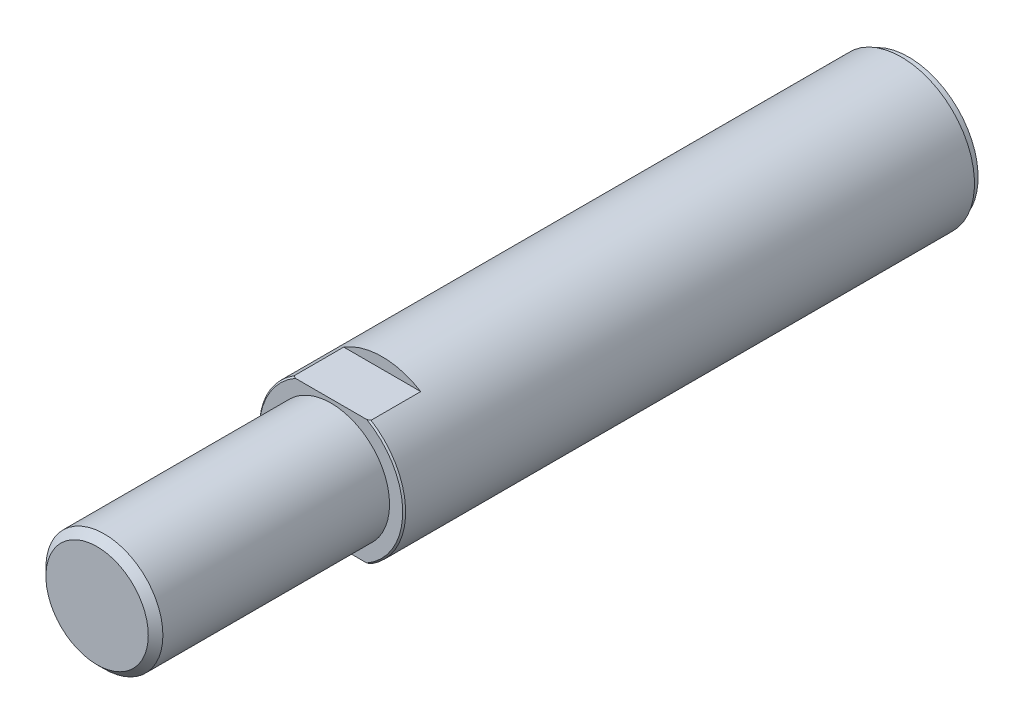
ISO-10303-21;
HEADER;
FILE_DESCRIPTION(('STEP AP214'),'2;1');
FILE_NAME('part.step','',(''),(''),'','','');
FILE_SCHEMA(('AUTOMOTIVE_DESIGN { 1 0 10303 214 1 1 1 1 }'));
ENDSEC;
DATA;
#1=APPLICATION_CONTEXT('core data for automotive mechanical design processes');
#2=APPLICATION_PROTOCOL_DEFINITION('international standard','automotive_design',2000,#1);
#3=PRODUCT_CONTEXT('',#1,'mechanical');
#4=PRODUCT('Part','Part','',(#3));
#5=PRODUCT_RELATED_PRODUCT_CATEGORY('part','',(#4));
#6=PRODUCT_DEFINITION_FORMATION('','',#4);
#7=PRODUCT_DEFINITION_CONTEXT('part definition',#1,'design');
#8=PRODUCT_DEFINITION('design','',#6,#7);
#9=PRODUCT_DEFINITION_SHAPE('','',#8);
#10=(LENGTH_UNIT() NAMED_UNIT(*) SI_UNIT(.MILLI.,.METRE.));
#11=(NAMED_UNIT(*) PLANE_ANGLE_UNIT() SI_UNIT($,.RADIAN.));
#12=(NAMED_UNIT(*) SI_UNIT($,.STERADIAN.) SOLID_ANGLE_UNIT());
#13=UNCERTAINTY_MEASURE_WITH_UNIT(LENGTH_MEASURE(1.E-05),#10,'distance_accuracy_value','');
#14=(GEOMETRIC_REPRESENTATION_CONTEXT(3) GLOBAL_UNCERTAINTY_ASSIGNED_CONTEXT((#13)) GLOBAL_UNIT_ASSIGNED_CONTEXT((#10,
#11,#12)) REPRESENTATION_CONTEXT('',''));
#15=CARTESIAN_POINT('',(0.,0.,0.));
#16=DIRECTION('',(0.,0.,1.));
#17=DIRECTION('',(1.,0.,0.));
#18=AXIS2_PLACEMENT_3D('',#15,#16,#17);
#19=CARTESIAN_POINT('',(0.,0.,111.));
#20=DIRECTION('',(0.,0.,-1.));
#21=DIRECTION('',(-1.,0.,0.));
#22=AXIS2_PLACEMENT_3D('',#19,#20,#21);
#23=CYLINDRICAL_SURFACE('',#22,10.);
#24=CARTESIAN_POINT('',(0.,0.,1.));
#25=DIRECTION('',(0.,0.,-1.));
#26=DIRECTION('',(-1.,0.,0.));
#27=AXIS2_PLACEMENT_3D('',#24,#25,#26);
#28=CIRCLE('',#27,10.);
#29=CARTESIAN_POINT('',(-10.,0.,1.));
#30=VERTEX_POINT('',#29);
#31=EDGE_CURVE('E197',#30,#30,#28,.T.);
#32=ORIENTED_EDGE('',*,*,#31,.F.);
#33=EDGE_LOOP('',(#32));
#34=FACE_BOUND('',#33,.T.);
#35=DIRECTION('',(0.,0.,-1.));
#36=VECTOR('',#35,1.);
#37=CARTESIAN_POINT('',(-5.26782687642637,-8.5,111.));
#38=LINE('',#37,#36);
#39=CARTESIAN_POINT('',(-5.26782687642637,-8.5,78.8));
#40=VERTEX_POINT('',#39);
#41=CARTESIAN_POINT('',(-5.26782687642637,-8.5,72.));
#42=VERTEX_POINT('',#41);
#43=EDGE_CURVE('E209',#40,#42,#38,.T.);
#44=ORIENTED_EDGE('',*,*,#43,.F.);
#45=CARTESIAN_POINT('',(0.,0.,78.8));
#46=DIRECTION('',(0.,0.,1.));
#47=DIRECTION('',(1.,0.,0.));
#48=AXIS2_PLACEMENT_3D('',#45,#46,#47);
#49=CIRCLE('',#48,10.);
#50=CARTESIAN_POINT('',(-5.26782687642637,8.5,78.8));
#51=VERTEX_POINT('',#50);
#52=EDGE_CURVE('E129',#40,#51,#49,.F.);
#53=ORIENTED_EDGE('',*,*,#52,.T.);
#54=DIRECTION('',(0.,0.,-1.));
#55=VECTOR('',#54,1.);
#56=CARTESIAN_POINT('',(-5.26782687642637,8.5,111.));
#57=LINE('',#56,#55);
#58=CARTESIAN_POINT('',(-5.26782687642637,8.5,72.));
#59=VERTEX_POINT('',#58);
#60=EDGE_CURVE('E58',#59,#51,#57,.F.);
#61=ORIENTED_EDGE('',*,*,#60,.F.);
#62=CARTESIAN_POINT('',(0.,0.,72.));
#63=DIRECTION('',(0.,0.,1.));
#64=DIRECTION('',(1.,0.,0.));
#65=AXIS2_PLACEMENT_3D('',#62,#63,#64);
#66=CIRCLE('',#65,10.);
#67=CARTESIAN_POINT('',(5.26782687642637,8.5,72.));
#68=VERTEX_POINT('',#67);
#69=EDGE_CURVE('E47',#68,#59,#66,.T.);
#70=ORIENTED_EDGE('',*,*,#69,.F.);
#71=DIRECTION('',(0.,0.,-1.));
#72=VECTOR('',#71,1.);
#73=CARTESIAN_POINT('',(5.26782687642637,8.5,111.));
#74=LINE('',#73,#72);
#75=CARTESIAN_POINT('',(5.26782687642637,8.5,78.8));
#76=VERTEX_POINT('',#75);
#77=EDGE_CURVE('E214',#76,#68,#74,.T.);
#78=ORIENTED_EDGE('',*,*,#77,.F.);
#79=CARTESIAN_POINT('',(5.26782687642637,-8.5,78.8));
#80=VERTEX_POINT('',#79);
#81=EDGE_CURVE('E116',#76,#80,#49,.F.);
#82=ORIENTED_EDGE('',*,*,#81,.T.);
#83=DIRECTION('',(0.,0.,-1.));
#84=VECTOR('',#83,1.);
#85=CARTESIAN_POINT('',(5.26782687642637,-8.5,111.));
#86=LINE('',#85,#84);
#87=CARTESIAN_POINT('',(5.26782687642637,-8.5,72.));
#88=VERTEX_POINT('',#87);
#89=EDGE_CURVE('E66',#88,#80,#86,.F.);
#90=ORIENTED_EDGE('',*,*,#89,.F.);
#91=EDGE_CURVE('E12',#42,#88,#66,.T.);
#92=ORIENTED_EDGE('',*,*,#91,.F.);
#93=EDGE_LOOP('',(#44,#53,#61,#70,#78,#82,#90,#92));
#94=FACE_BOUND('',#93,.T.);
#95=ADVANCED_FACE('F42',(#34,#94),#23,.T.);
#96=CARTESIAN_POINT('',(0.,0.,79.));
#97=DIRECTION('',(0.,0.,1.));
#98=DIRECTION('',(1.,0.,0.));
#99=AXIS2_PLACEMENT_3D('',#96,#97,#98);
#100=PLANE('',#99);
#101=CARTESIAN_POINT('',(0.,0.,79.));
#102=DIRECTION('',(0.,0.,1.));
#103=DIRECTION('',(1.,0.,0.));
#104=AXIS2_PLACEMENT_3D('',#101,#102,#103);
#105=CIRCLE('',#104,8.);
#106=CARTESIAN_POINT('',(8.,0.,79.));
#107=VERTEX_POINT('',#106);
#108=EDGE_CURVE('E192',#107,#107,#105,.T.);
#109=ORIENTED_EDGE('',*,*,#108,.F.);
#110=EDGE_LOOP('',(#109));
#111=FACE_BOUND('',#110,.T.);
#112=CARTESIAN_POINT('',(0.,0.,79.));
#113=DIRECTION('',(0.,0.,1.));
#114=DIRECTION('',(1.,0.,0.));
#115=AXIS2_PLACEMENT_3D('',#112,#113,#114);
#116=CIRCLE('',#115,9.8);
#117=CARTESIAN_POINT('',(-4.87749935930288,8.5,79.));
#118=VERTEX_POINT('',#117);
#119=CARTESIAN_POINT('',(-4.87749935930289,-8.5,79.));
#120=VERTEX_POINT('',#119);
#121=EDGE_CURVE('E121',#118,#120,#116,.T.);
#122=ORIENTED_EDGE('',*,*,#121,.T.);
#123=DIRECTION('',(1.,0.,0.));
#124=VECTOR('',#123,1.);
#125=CARTESIAN_POINT('',(-15.7370542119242,-8.5,79.));
#126=LINE('',#125,#124);
#127=CARTESIAN_POINT('',(4.87749935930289,-8.5,79.));
#128=VERTEX_POINT('',#127);
#129=EDGE_CURVE('E108',#120,#128,#126,.T.);
#130=ORIENTED_EDGE('',*,*,#129,.T.);
#131=CARTESIAN_POINT('',(4.87749935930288,8.5,79.));
#132=VERTEX_POINT('',#131);
#133=EDGE_CURVE('E114',#128,#132,#116,.T.);
#134=ORIENTED_EDGE('',*,*,#133,.T.);
#135=DIRECTION('',(-1.,0.,0.));
#136=VECTOR('',#135,1.);
#137=CARTESIAN_POINT('',(-15.7370542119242,8.5,79.));
#138=LINE('',#137,#136);
#139=EDGE_CURVE('E98',#132,#118,#138,.T.);
#140=ORIENTED_EDGE('',*,*,#139,.T.);
#141=EDGE_LOOP('',(#122,#130,#134,#140));
#142=FACE_BOUND('',#141,.T.);
#143=ADVANCED_FACE('F120',(#111,#142),#100,.T.);
#144=CARTESIAN_POINT('',(0.,0.,79.));
#145=DIRECTION('',(0.,0.,-1.));
#146=DIRECTION('',(-1.,0.,0.));
#147=AXIS2_PLACEMENT_3D('',#144,#145,#146);
#148=CONICAL_SURFACE('',#147,9.8,0.785398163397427);
#149=ORIENTED_EDGE('',*,*,#52,.F.);
#150=CARTESIAN_POINT('',(-20.2924912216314,-8.5,66.7992000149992));
#151=CARTESIAN_POINT('',(-19.9903151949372,-8.5,67.0779050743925));
#152=CARTESIAN_POINT('',(-19.6876831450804,-8.5,67.3561166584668));
#153=CARTESIAN_POINT('',(-19.0813686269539,-8.5,67.9113972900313));
#154=CARTESIAN_POINT('',(-18.7776861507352,-8.5,68.1884663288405));
#155=CARTESIAN_POINT('',(-18.1690691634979,-8.5,68.7413636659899));
#156=CARTESIAN_POINT('',(-17.8641343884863,-8.5,69.0171916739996));
#157=CARTESIAN_POINT('',(-17.2529099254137,-8.5,69.5673395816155));
#158=CARTESIAN_POINT('',(-16.9466202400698,-8.5,69.8416594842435));
#159=CARTESIAN_POINT('',(-16.0217547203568,-8.5,70.6653051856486));
#160=CARTESIAN_POINT('',(-15.400823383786,-8.5,71.2119999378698));
#161=CARTESIAN_POINT('',(-14.4631651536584,-8.5,72.0247482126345));
#162=CARTESIAN_POINT('',(-14.1495854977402,-8.5,72.294434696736));
#163=CARTESIAN_POINT('',(-13.5199535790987,-8.5,72.8309076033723));
#164=CARTESIAN_POINT('',(-13.2039013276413,-8.5,73.0976940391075));
#165=CARTESIAN_POINT('',(-12.629428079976,-8.5,73.5772387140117));
#166=CARTESIAN_POINT('',(-12.3715096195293,-8.5,73.7905987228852));
#167=CARTESIAN_POINT('',(-11.8534786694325,-8.5,74.2146372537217));
#168=CARTESIAN_POINT('',(-11.5933661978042,-8.5,74.4253157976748));
#169=CARTESIAN_POINT('',(-11.0705368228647,-8.5,74.843561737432));
#170=CARTESIAN_POINT('',(-10.8078192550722,-8.5,75.0511283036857));
#171=CARTESIAN_POINT('',(-10.2794399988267,-8.5,75.4624820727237));
#172=CARTESIAN_POINT('',(-10.0137783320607,-8.5,75.6662693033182));
#173=CARTESIAN_POINT('',(-9.47930850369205,-8.5,76.0690746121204));
#174=CARTESIAN_POINT('',(-9.21050406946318,-8.5,76.268097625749));
#175=CARTESIAN_POINT('',(-8.6688683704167,-8.5,76.6606243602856));
#176=CARTESIAN_POINT('',(-8.39603694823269,-8.5,76.8541278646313));
#177=CARTESIAN_POINT('',(-7.84577438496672,-8.5,77.2342487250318));
#178=CARTESIAN_POINT('',(-7.56834525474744,-8.5,77.4208689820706));
#179=CARTESIAN_POINT('',(-7.00798119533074,-8.5,77.7856209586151));
#180=CARTESIAN_POINT('',(-6.72504689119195,-8.5,77.963753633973));
#181=CARTESIAN_POINT('',(-6.15573417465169,-8.5,78.307521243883));
#182=CARTESIAN_POINT('',(-5.86942405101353,-8.5,78.4732686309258));
#183=CARTESIAN_POINT('',(-5.28944259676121,-8.5,78.7915327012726));
#184=CARTESIAN_POINT('',(-4.99577045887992,-8.5,78.9440479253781));
#185=CARTESIAN_POINT('',(-4.40042128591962,-8.5,79.2320384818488));
#186=CARTESIAN_POINT('',(-4.09875133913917,-8.5,79.3675283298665));
#187=CARTESIAN_POINT('',(-3.48658234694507,-8.5,79.6169596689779));
#188=CARTESIAN_POINT('',(-3.176085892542,-8.5,79.7309074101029));
#189=CARTESIAN_POINT('',(-2.61467210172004,-8.5,79.9100093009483));
#190=CARTESIAN_POINT('',(-2.36543038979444,-8.5,79.9803861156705));
#191=CARTESIAN_POINT('',(-1.86224774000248,-8.5,80.1018154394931));
#192=CARTESIAN_POINT('',(-1.6083074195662,-8.5,80.1528704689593));
#193=CARTESIAN_POINT('',(-1.0977393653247,-8.5,80.2331036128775));
#194=CARTESIAN_POINT('',(-0.841122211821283,-8.5,80.2623480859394));
#195=CARTESIAN_POINT('',(-0.326281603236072,-8.5,80.29761577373));
#196=CARTESIAN_POINT('',(-0.0680582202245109,-8.5,80.3036400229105));
#197=CARTESIAN_POINT('',(0.448290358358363,-8.5,80.2921082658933));
#198=CARTESIAN_POINT('',(0.70641464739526,-8.5,80.2745123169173));
#199=CARTESIAN_POINT('',(1.22009338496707,-8.5,80.216676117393));
#200=CARTESIAN_POINT('',(1.47564761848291,-8.5,80.1764339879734));
#201=CARTESIAN_POINT('',(1.98337628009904,-8.5,80.0752276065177));
#202=CARTESIAN_POINT('',(2.23553793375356,-8.5,80.0142001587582));
#203=CARTESIAN_POINT('',(2.73474214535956,-8.5,79.8741177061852));
#204=CARTESIAN_POINT('',(2.98178457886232,-8.5,79.7950622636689));
#205=CARTESIAN_POINT('',(3.50854802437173,-8.5,79.608148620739));
#206=CARTESIAN_POINT('',(3.78735046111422,-8.5,79.4977206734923));
#207=CARTESIAN_POINT('',(4.33788024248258,-8.5,79.2603215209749));
#208=CARTESIAN_POINT('',(4.60960435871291,-8.5,79.1333429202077));
#209=CARTESIAN_POINT('',(5.14688206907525,-8.5,78.8659166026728));
#210=CARTESIAN_POINT('',(5.41242408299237,-8.5,78.7254457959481));
#211=CARTESIAN_POINT('',(5.9375223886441,-8.5,78.4338769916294));
#212=CARTESIAN_POINT('',(6.19707948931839,-8.5,78.282780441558));
#213=CARTESIAN_POINT('',(6.71410320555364,-8.5,77.9701206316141));
#214=CARTESIAN_POINT('',(6.97150611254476,-8.5,77.808452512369));
#215=CARTESIAN_POINT('',(7.48168749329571,-8.5,77.4779909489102));
#216=CARTESIAN_POINT('',(7.73446585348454,-8.5,77.3091973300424));
#217=CARTESIAN_POINT('',(8.2357615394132,-8.5,76.9659626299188));
#218=CARTESIAN_POINT('',(8.48428301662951,-8.5,76.7915275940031));
#219=CARTESIAN_POINT('',(8.97788664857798,-8.5,76.4378472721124));
#220=CARTESIAN_POINT('',(9.22296865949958,-8.5,76.2586017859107));
#221=CARTESIAN_POINT('',(9.7110747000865,-8.5,75.895416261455));
#222=CARTESIAN_POINT('',(9.9540873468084,-8.5,75.7114609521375));
#223=CARTESIAN_POINT('',(10.4375034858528,-8.5,75.3401497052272));
#224=CARTESIAN_POINT('',(10.6779069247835,-8.5,75.1527936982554));
#225=CARTESIAN_POINT('',(11.3957533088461,-8.5,74.5863995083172));
#226=CARTESIAN_POINT('',(11.8698018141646,-8.5,74.2030580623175));
#227=CARTESIAN_POINT('',(12.8113026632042,-8.5,73.4276757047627));
#228=CARTESIAN_POINT('',(13.2787496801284,-8.5,73.0356283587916));
#229=CARTESIAN_POINT('',(14.2082094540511,-8.5,72.2451370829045));
#230=CARTESIAN_POINT('',(14.6702221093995,-8.5,71.8466930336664));
#231=CARTESIAN_POINT('',(15.5667112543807,-8.5,71.065095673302));
#232=CARTESIAN_POINT('',(16.0014004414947,-8.5,70.6821858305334));
#233=CARTESIAN_POINT('',(16.8676102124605,-8.5,69.9127893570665));
#234=CARTESIAN_POINT('',(17.2991307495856,-8.5,69.5263026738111));
#235=CARTESIAN_POINT('',(18.1588700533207,-8.5,68.7510598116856));
#236=CARTESIAN_POINT('',(18.5870930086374,-8.5,68.362308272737));
#237=CARTESIAN_POINT('',(19.4413362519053,-8.5,67.5824227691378));
#238=CARTESIAN_POINT('',(19.8673566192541,-8.5,67.1912888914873));
#239=CARTESIAN_POINT('',(20.2924912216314,-8.5,66.7992000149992));
#240=B_SPLINE_CURVE_WITH_KNOTS('',3,(#150,#151,#152,#153,#154,#155,#156,#157,#158,#159,#160,
#161,#162,#163,#164,#165,#166,#167,#168,#169,#170,#171,#172,#173,#174,#175,#176,#177,#178,#179,
#180,#181,#182,#183,#184,#185,#186,#187,#188,#189,#190,#191,#192,#193,#194,#195,#196,#197,#198,
#199,#200,#201,#202,#203,#204,#205,#206,#207,#208,#209,#210,#211,#212,#213,#214,#215,#216,#217,
#218,#219,#220,#221,#222,#223,#224,#225,#226,#227,#228,#229,#230,#231,#232,#233,#234,#235,#236,
#237,#238,#239),.UNSPECIFIED.,.F.,.F.,(4,2,2,2,2,2,2,2,2,2,2,2,2,2,2,2,2,2,2,2,2,2,2,2,2,2,2,2,
2,2,2,2,2,2,2,2,2,2,2,2,2,2,2,2,4),(0.,1.23324065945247,2.46649067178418,3.70001557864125,
4.93353801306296,7.41535843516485,8.65613838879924,9.89691269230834,10.9010889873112,
11.9052570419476,12.9096881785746,13.914111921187,14.9174456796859,15.920818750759,
16.9237639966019,17.9265960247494,18.9187990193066,19.9111112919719,20.9025717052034,
21.8937440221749,22.6700519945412,23.4462586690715,24.2200939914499,24.9938948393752,
25.7690058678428,26.5441812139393,27.3217347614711,28.0993071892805,28.9982580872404,
29.8976120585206,30.7985335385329,31.699332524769,32.6110754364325,33.522840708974,
34.433659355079,35.3445159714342,36.2588393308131,37.1731813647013,39.0019798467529,
40.832178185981,42.6624107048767,44.4002517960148,46.1381184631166,47.8731949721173,
49.6082084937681),.UNSPECIFIED.);
#241=EDGE_CURVE('E230',#40,#120,#240,.T.);
#242=ORIENTED_EDGE('',*,*,#241,.T.);
#243=ORIENTED_EDGE('',*,*,#121,.F.);
#244=CARTESIAN_POINT('',(20.2924912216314,8.5,66.7992000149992));
#245=CARTESIAN_POINT('',(19.9903151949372,8.5,67.0779050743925));
#246=CARTESIAN_POINT('',(19.6876831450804,8.5,67.3561166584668));
#247=CARTESIAN_POINT('',(19.0813686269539,8.5,67.9113972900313));
#248=CARTESIAN_POINT('',(18.7776861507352,8.5,68.1884663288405));
#249=CARTESIAN_POINT('',(18.1690691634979,8.5,68.7413636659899));
#250=CARTESIAN_POINT('',(17.8641343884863,8.5,69.0171916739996));
#251=CARTESIAN_POINT('',(17.2529099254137,8.5,69.5673395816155));
#252=CARTESIAN_POINT('',(16.9466202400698,8.5,69.8416594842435));
#253=CARTESIAN_POINT('',(16.0217547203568,8.5,70.6653051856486));
#254=CARTESIAN_POINT('',(15.400823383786,8.5,71.2119999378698));
#255=CARTESIAN_POINT('',(14.4631651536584,8.5,72.0247482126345));
#256=CARTESIAN_POINT('',(14.1495854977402,8.5,72.294434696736));
#257=CARTESIAN_POINT('',(13.5199535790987,8.5,72.8309076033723));
#258=CARTESIAN_POINT('',(13.2039013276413,8.5,73.0976940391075));
#259=CARTESIAN_POINT('',(12.629428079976,8.5,73.5772387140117));
#260=CARTESIAN_POINT('',(12.3715096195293,8.5,73.7905987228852));
#261=CARTESIAN_POINT('',(11.8534786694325,8.5,74.2146372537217));
#262=CARTESIAN_POINT('',(11.5933661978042,8.5,74.4253157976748));
#263=CARTESIAN_POINT('',(11.0705368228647,8.5,74.843561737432));
#264=CARTESIAN_POINT('',(10.8078192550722,8.5,75.0511283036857));
#265=CARTESIAN_POINT('',(10.2794399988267,8.5,75.4624820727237));
#266=CARTESIAN_POINT('',(10.0137783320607,8.5,75.6662693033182));
#267=CARTESIAN_POINT('',(9.47930850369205,8.5,76.0690746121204));
#268=CARTESIAN_POINT('',(9.21050406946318,8.5,76.268097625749));
#269=CARTESIAN_POINT('',(8.6688683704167,8.5,76.6606243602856));
#270=CARTESIAN_POINT('',(8.39603694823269,8.5,76.8541278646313));
#271=CARTESIAN_POINT('',(7.84577438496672,8.5,77.2342487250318));
#272=CARTESIAN_POINT('',(7.56834525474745,8.5,77.4208689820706));
#273=CARTESIAN_POINT('',(7.00798119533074,8.5,77.7856209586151));
#274=CARTESIAN_POINT('',(6.72504689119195,8.5,77.963753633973));
#275=CARTESIAN_POINT('',(6.15573417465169,8.5,78.307521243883));
#276=CARTESIAN_POINT('',(5.86942405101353,8.5,78.4732686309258));
#277=CARTESIAN_POINT('',(5.28944259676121,8.5,78.7915327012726));
#278=CARTESIAN_POINT('',(4.99577045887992,8.5,78.9440479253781));
#279=CARTESIAN_POINT('',(4.40042128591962,8.5,79.2320384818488));
#280=CARTESIAN_POINT('',(4.09875133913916,8.5,79.3675283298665));
#281=CARTESIAN_POINT('',(3.48658234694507,8.5,79.6169596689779));
#282=CARTESIAN_POINT('',(3.17608589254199,8.5,79.7309074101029));
#283=CARTESIAN_POINT('',(2.61467210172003,8.5,79.9100093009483));
#284=CARTESIAN_POINT('',(2.36543038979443,8.5,79.9803861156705));
#285=CARTESIAN_POINT('',(1.86224774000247,8.5,80.1018154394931));
#286=CARTESIAN_POINT('',(1.60830741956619,8.5,80.1528704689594));
#287=CARTESIAN_POINT('',(1.09773936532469,8.5,80.2331036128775));
#288=CARTESIAN_POINT('',(0.841122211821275,8.5,80.2623480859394));
#289=CARTESIAN_POINT('',(0.326281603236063,8.5,80.29761577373));
#290=CARTESIAN_POINT('',(0.0680582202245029,8.5,80.3036400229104));
#291=CARTESIAN_POINT('',(-0.448290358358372,8.5,80.2921082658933));
#292=CARTESIAN_POINT('',(-0.70641464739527,8.5,80.2745123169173));
#293=CARTESIAN_POINT('',(-1.22009338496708,8.5,80.216676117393));
#294=CARTESIAN_POINT('',(-1.47564761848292,8.5,80.1764339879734));
#295=CARTESIAN_POINT('',(-1.98337628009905,8.5,80.0752276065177));
#296=CARTESIAN_POINT('',(-2.23553793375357,8.5,80.0142001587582));
#297=CARTESIAN_POINT('',(-2.73474214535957,8.5,79.8741177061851));
#298=CARTESIAN_POINT('',(-2.98178457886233,8.5,79.7950622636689));
#299=CARTESIAN_POINT('',(-3.50854802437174,8.5,79.6081486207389));
#300=CARTESIAN_POINT('',(-3.78735046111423,8.5,79.4977206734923));
#301=CARTESIAN_POINT('',(-4.33788024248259,8.5,79.2603215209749));
#302=CARTESIAN_POINT('',(-4.60960435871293,8.5,79.1333429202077));
#303=CARTESIAN_POINT('',(-5.14688206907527,8.5,78.8659166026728));
#304=CARTESIAN_POINT('',(-5.41242408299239,8.5,78.7254457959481));
#305=CARTESIAN_POINT('',(-5.93752238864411,8.5,78.4338769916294));
#306=CARTESIAN_POINT('',(-6.19707948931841,8.5,78.282780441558));
#307=CARTESIAN_POINT('',(-6.71410320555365,8.5,77.9701206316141));
#308=CARTESIAN_POINT('',(-6.97150611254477,8.5,77.808452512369));
#309=CARTESIAN_POINT('',(-7.48168749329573,8.5,77.4779909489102));
#310=CARTESIAN_POINT('',(-7.73446585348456,8.5,77.3091973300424));
#311=CARTESIAN_POINT('',(-8.23576153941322,8.5,76.9659626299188));
#312=CARTESIAN_POINT('',(-8.48428301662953,8.5,76.7915275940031));
#313=CARTESIAN_POINT('',(-8.977886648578,8.5,76.4378472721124));
#314=CARTESIAN_POINT('',(-9.2229686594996,8.5,76.2586017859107));
#315=CARTESIAN_POINT('',(-9.71107470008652,8.5,75.8954162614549));
#316=CARTESIAN_POINT('',(-9.95408734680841,8.5,75.7114609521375));
#317=CARTESIAN_POINT('',(-10.4375034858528,8.5,75.3401497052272));
#318=CARTESIAN_POINT('',(-10.6779069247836,8.5,75.1527936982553));
#319=CARTESIAN_POINT('',(-11.3957533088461,8.5,74.5863995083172));
#320=CARTESIAN_POINT('',(-11.8698018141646,8.5,74.2030580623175));
#321=CARTESIAN_POINT('',(-12.8113026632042,8.5,73.4276757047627));
#322=CARTESIAN_POINT('',(-13.2787496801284,8.5,73.0356283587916));
#323=CARTESIAN_POINT('',(-14.2082094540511,8.5,72.2451370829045));
#324=CARTESIAN_POINT('',(-14.6702221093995,8.5,71.8466930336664));
#325=CARTESIAN_POINT('',(-15.5667112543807,8.5,71.065095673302));
#326=CARTESIAN_POINT('',(-16.0014004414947,8.5,70.6821858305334));
#327=CARTESIAN_POINT('',(-16.8676102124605,8.5,69.9127893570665));
#328=CARTESIAN_POINT('',(-17.2991307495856,8.5,69.5263026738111));
#329=CARTESIAN_POINT('',(-18.1588700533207,8.5,68.7510598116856));
#330=CARTESIAN_POINT('',(-18.5870930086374,8.5,68.362308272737));
#331=CARTESIAN_POINT('',(-19.4413362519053,8.5,67.5824227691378));
#332=CARTESIAN_POINT('',(-19.8673566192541,8.5,67.1912888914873));
#333=CARTESIAN_POINT('',(-20.2924912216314,8.5,66.7992000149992));
#334=B_SPLINE_CURVE_WITH_KNOTS('',3,(#244,#245,#246,#247,#248,#249,#250,#251,#252,#253,#254,
#255,#256,#257,#258,#259,#260,#261,#262,#263,#264,#265,#266,#267,#268,#269,#270,#271,#272,#273,
#274,#275,#276,#277,#278,#279,#280,#281,#282,#283,#284,#285,#286,#287,#288,#289,#290,#291,#292,
#293,#294,#295,#296,#297,#298,#299,#300,#301,#302,#303,#304,#305,#306,#307,#308,#309,#310,#311,
#312,#313,#314,#315,#316,#317,#318,#319,#320,#321,#322,#323,#324,#325,#326,#327,#328,#329,#330,
#331,#332,#333),.UNSPECIFIED.,.F.,.F.,(4,2,2,2,2,2,2,2,2,2,2,2,2,2,2,2,2,2,2,2,2,2,2,2,2,2,2,2,
2,2,2,2,2,2,2,2,2,2,2,2,2,2,2,2,4),(0.,1.23324065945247,2.46649067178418,3.70001557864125,
4.93353801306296,7.41535843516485,8.65613838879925,9.89691269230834,10.9010889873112,
11.9052570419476,12.9096881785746,13.914111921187,14.9174456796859,15.920818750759,
16.9237639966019,17.9265960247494,18.9187990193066,19.9111112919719,20.9025717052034,
21.8937440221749,22.6700519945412,23.4462586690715,24.2200939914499,24.9938948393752,
25.7690058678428,26.5441812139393,27.3217347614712,28.0993071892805,28.9982580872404,
29.8976120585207,30.7985335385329,31.699332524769,32.6110754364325,33.522840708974,
34.433659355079,35.3445159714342,36.2588393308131,37.1731813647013,39.0019798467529,
40.832178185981,42.6624107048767,44.4002517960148,46.1381184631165,47.8731949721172,
49.6082084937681),.UNSPECIFIED.);
#335=EDGE_CURVE('E103',#118,#51,#334,.T.);
#336=ORIENTED_EDGE('',*,*,#335,.T.);
#337=EDGE_LOOP('',(#149,#242,#243,#336));
#338=FACE_BOUND('',#337,.T.);
#339=ADVANCED_FACE('F44',(#338),#148,.T.);
#340=ORIENTED_EDGE('',*,*,#133,.F.);
#341=EDGE_CURVE('E117',#128,#80,#240,.T.);
#342=ORIENTED_EDGE('',*,*,#341,.T.);
#343=ORIENTED_EDGE('',*,*,#81,.F.);
#344=EDGE_CURVE('E101',#76,#132,#334,.T.);
#345=ORIENTED_EDGE('',*,*,#344,.T.);
#346=EDGE_LOOP('',(#340,#342,#343,#345));
#347=FACE_BOUND('',#346,.T.);
#348=ADVANCED_FACE('F113',(#347),#148,.T.);
#349=CARTESIAN_POINT('',(0.,0.,79.));
#350=DIRECTION('',(0.,0.,1.));
#351=DIRECTION('',(1.,0.,0.));
#352=AXIS2_PLACEMENT_3D('',#349,#350,#351);
#353=CYLINDRICAL_SURFACE('',#352,8.);
#354=CARTESIAN_POINT('',(0.,0.,110.));
#355=DIRECTION('',(0.,0.,1.));
#356=DIRECTION('',(1.,0.,0.));
#357=AXIS2_PLACEMENT_3D('',#354,#355,#356);
#358=CIRCLE('',#357,8.);
#359=CARTESIAN_POINT('',(8.,0.,110.));
#360=VERTEX_POINT('',#359);
#361=EDGE_CURVE('E122',#360,#360,#358,.F.);
#362=ORIENTED_EDGE('',*,*,#361,.T.);
#363=EDGE_LOOP('',(#362));
#364=FACE_BOUND('',#363,.T.);
#365=ORIENTED_EDGE('',*,*,#108,.T.);
#366=EDGE_LOOP('',(#365));
#367=FACE_BOUND('',#366,.T.);
#368=ADVANCED_FACE('F169',(#364,#367),#353,.T.);
#369=CARTESIAN_POINT('',(0.,0.,111.));
#370=DIRECTION('',(0.,0.,1.));
#371=DIRECTION('',(1.,0.,0.));
#372=AXIS2_PLACEMENT_3D('',#369,#370,#371);
#373=PLANE('',#372);
#374=CARTESIAN_POINT('',(0.,0.,111.));
#375=DIRECTION('',(0.,0.,1.));
#376=DIRECTION('',(1.,0.,0.));
#377=AXIS2_PLACEMENT_3D('',#374,#375,#376);
#378=CIRCLE('',#377,7.00000000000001);
#379=CARTESIAN_POINT('',(7.00000000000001,0.,111.));
#380=VERTEX_POINT('',#379);
#381=EDGE_CURVE('E125',#380,#380,#378,.T.);
#382=ORIENTED_EDGE('',*,*,#381,.T.);
#383=EDGE_LOOP('',(#382));
#384=FACE_BOUND('',#383,.T.);
#385=ADVANCED_FACE('F159',(#384),#373,.T.);
#386=CARTESIAN_POINT('',(0.,0.,1.));
#387=DIRECTION('',(0.,0.,-1.));
#388=DIRECTION('',(-1.,0.,0.));
#389=AXIS2_PLACEMENT_3D('',#386,#387,#388);
#390=PLANE('',#389);
#391=CARTESIAN_POINT('',(0.,0.,1.));
#392=DIRECTION('',(0.,0.,-1.));
#393=DIRECTION('',(-1.,0.,0.));
#394=AXIS2_PLACEMENT_3D('',#391,#392,#393);
#395=CIRCLE('',#394,9.5);
#396=CARTESIAN_POINT('',(-9.5,0.,1.));
#397=VERTEX_POINT('',#396);
#398=EDGE_CURVE('E200',#397,#397,#395,.T.);
#399=ORIENTED_EDGE('',*,*,#398,.F.);
#400=EDGE_LOOP('',(#399));
#401=FACE_BOUND('',#400,.T.);
#402=ORIENTED_EDGE('',*,*,#31,.T.);
#403=EDGE_LOOP('',(#402));
#404=FACE_BOUND('',#403,.T.);
#405=ADVANCED_FACE('F155',(#401,#404),#390,.T.);
#406=CARTESIAN_POINT('',(0.,0.,1.));
#407=DIRECTION('',(0.,0.,-1.));
#408=DIRECTION('',(-1.,0.,0.));
#409=AXIS2_PLACEMENT_3D('',#406,#407,#408);
#410=CYLINDRICAL_SURFACE('',#409,9.5);
#411=ORIENTED_EDGE('',*,*,#398,.T.);
#412=EDGE_LOOP('',(#411));
#413=FACE_BOUND('',#412,.T.);
#414=CARTESIAN_POINT('',(0.,0.,0.));
#415=DIRECTION('',(0.,0.,-1.));
#416=DIRECTION('',(-1.,0.,0.));
#417=AXIS2_PLACEMENT_3D('',#414,#415,#416);
#418=CIRCLE('',#417,9.5);
#419=CARTESIAN_POINT('',(-9.5,0.,0.));
#420=VERTEX_POINT('',#419);
#421=EDGE_CURVE('E206',#420,#420,#418,.T.);
#422=ORIENTED_EDGE('',*,*,#421,.F.);
#423=EDGE_LOOP('',(#422));
#424=FACE_BOUND('',#423,.T.);
#425=ADVANCED_FACE('F151',(#413,#424),#410,.T.);
#426=CARTESIAN_POINT('',(0.,0.,27.5));
#427=DIRECTION('',(0.,0.,-1.));
#428=DIRECTION('',(-1.,0.,0.));
#429=AXIS2_PLACEMENT_3D('',#426,#427,#428);
#430=CONICAL_SURFACE('',#429,4.24999999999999,1.02974425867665);
#431=CARTESIAN_POINT('',(0.,0.,30.0536576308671));
#432=VERTEX_POINT('',#431);
#433=VERTEX_LOOP('',#432);
#434=FACE_BOUND('',#433,.T.);
#435=CARTESIAN_POINT('',(0.,0.,27.5));
#436=DIRECTION('',(0.,0.,-1.));
#437=DIRECTION('',(-1.,0.,0.));
#438=AXIS2_PLACEMENT_3D('',#435,#436,#437);
#439=CIRCLE('',#438,4.24999999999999);
#440=CARTESIAN_POINT('',(-4.24999999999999,0.,27.5));
#441=VERTEX_POINT('',#440);
#442=EDGE_CURVE('E194',#441,#441,#439,.T.);
#443=ORIENTED_EDGE('',*,*,#442,.T.);
#444=EDGE_LOOP('',(#443));
#445=FACE_BOUND('',#444,.T.);
#446=ADVANCED_FACE('F154',(#434,#445),#430,.F.);
#447=CARTESIAN_POINT('',(0.,0.,0.));
#448=DIRECTION('',(0.,0.,-1.));
#449=DIRECTION('',(-1.,0.,0.));
#450=AXIS2_PLACEMENT_3D('',#447,#448,#449);
#451=CYLINDRICAL_SURFACE('',#450,4.25);
#452=ORIENTED_EDGE('',*,*,#442,.F.);
#453=EDGE_LOOP('',(#452));
#454=FACE_BOUND('',#453,.T.);
#455=CARTESIAN_POINT('',(0.,0.,0.));
#456=DIRECTION('',(0.,0.,-1.));
#457=DIRECTION('',(-1.,0.,0.));
#458=AXIS2_PLACEMENT_3D('',#455,#456,#457);
#459=CIRCLE('',#458,4.25);
#460=CARTESIAN_POINT('',(-4.25,0.,0.));
#461=VERTEX_POINT('',#460);
#462=EDGE_CURVE('E199',#461,#461,#459,.T.);
#463=ORIENTED_EDGE('',*,*,#462,.T.);
#464=EDGE_LOOP('',(#463));
#465=FACE_BOUND('',#464,.T.);
#466=ADVANCED_FACE('F161',(#454,#465),#451,.F.);
#467=CARTESIAN_POINT('',(0.,0.,0.));
#468=DIRECTION('',(0.,0.,1.));
#469=DIRECTION('',(1.,0.,0.));
#470=AXIS2_PLACEMENT_3D('',#467,#468,#469);
#471=PLANE('',#470);
#472=ORIENTED_EDGE('',*,*,#462,.F.);
#473=EDGE_LOOP('',(#472));
#474=FACE_BOUND('',#473,.T.);
#475=ORIENTED_EDGE('',*,*,#421,.T.);
#476=EDGE_LOOP('',(#475));
#477=FACE_BOUND('',#476,.T.);
#478=ADVANCED_FACE('F164',(#474,#477),#471,.F.);
#479=CARTESIAN_POINT('',(0.,0.,111.));
#480=DIRECTION('',(0.,0.,-1.));
#481=DIRECTION('',(-1.,0.,0.));
#482=AXIS2_PLACEMENT_3D('',#479,#480,#481);
#483=CONICAL_SURFACE('',#482,7.00000000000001,0.785398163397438);
#484=ORIENTED_EDGE('',*,*,#361,.F.);
#485=EDGE_LOOP('',(#484));
#486=FACE_BOUND('',#485,.T.);
#487=ORIENTED_EDGE('',*,*,#381,.F.);
#488=EDGE_LOOP('',(#487));
#489=FACE_BOUND('',#488,.T.);
#490=ADVANCED_FACE('F144',(#486,#489),#483,.T.);
#491=CARTESIAN_POINT('',(-15.7370542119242,8.5,72.));
#492=DIRECTION('',(0.,1.,0.));
#493=DIRECTION('',(0.,0.,1.));
#494=AXIS2_PLACEMENT_3D('',#491,#492,#493);
#495=PLANE('',#494);
#496=ORIENTED_EDGE('',*,*,#77,.T.);
#497=DIRECTION('',(-1.,0.,0.));
#498=VECTOR('',#497,1.);
#499=CARTESIAN_POINT('',(-15.7370542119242,8.5,72.));
#500=LINE('',#499,#498);
#501=EDGE_CURVE('E218',#68,#59,#500,.T.);
#502=ORIENTED_EDGE('',*,*,#501,.T.);
#503=ORIENTED_EDGE('',*,*,#60,.T.);
#504=ORIENTED_EDGE('',*,*,#335,.F.);
#505=ORIENTED_EDGE('',*,*,#139,.F.);
#506=ORIENTED_EDGE('',*,*,#344,.F.);
#507=EDGE_LOOP('',(#496,#502,#503,#504,#505,#506));
#508=FACE_BOUND('',#507,.T.);
#509=ADVANCED_FACE('F100',(#508),#495,.T.);
#510=CARTESIAN_POINT('',(0.,0.,72.));
#511=DIRECTION('',(0.,0.,1.));
#512=DIRECTION('',(1.,0.,0.));
#513=AXIS2_PLACEMENT_3D('',#510,#511,#512);
#514=PLANE('',#513);
#515=ORIENTED_EDGE('',*,*,#69,.T.);
#516=ORIENTED_EDGE('',*,*,#501,.F.);
#517=EDGE_LOOP('',(#515,#516));
#518=FACE_BOUND('',#517,.T.);
#519=ADVANCED_FACE('F143',(#518),#514,.T.);
#520=ORIENTED_EDGE('',*,*,#91,.T.);
#521=DIRECTION('',(1.,0.,0.));
#522=VECTOR('',#521,1.);
#523=CARTESIAN_POINT('',(-15.7370542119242,-8.5,72.));
#524=LINE('',#523,#522);
#525=EDGE_CURVE('E217',#42,#88,#524,.T.);
#526=ORIENTED_EDGE('',*,*,#525,.F.);
#527=EDGE_LOOP('',(#520,#526));
#528=FACE_BOUND('',#527,.T.);
#529=ADVANCED_FACE('F149',(#528),#514,.T.);
#530=CARTESIAN_POINT('',(-15.7370542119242,-8.5,72.));
#531=DIRECTION('',(0.,-1.,0.));
#532=DIRECTION('',(0.,0.,-1.));
#533=AXIS2_PLACEMENT_3D('',#530,#531,#532);
#534=PLANE('',#533);
#535=ORIENTED_EDGE('',*,*,#43,.T.);
#536=ORIENTED_EDGE('',*,*,#525,.T.);
#537=ORIENTED_EDGE('',*,*,#89,.T.);
#538=ORIENTED_EDGE('',*,*,#341,.F.);
#539=ORIENTED_EDGE('',*,*,#129,.F.);
#540=ORIENTED_EDGE('',*,*,#241,.F.);
#541=EDGE_LOOP('',(#535,#536,#537,#538,#539,#540));
#542=FACE_BOUND('',#541,.T.);
#543=ADVANCED_FACE('F145',(#542),#534,.T.);
#544=CLOSED_SHELL('',(#95,#143,#339,#348,#368,#385,#405,#425,#446,#466,#478,#490,#509,#519,#529,#543));
#545=MANIFOLD_SOLID_BREP('B2',#544);
#546=ADVANCED_BREP_SHAPE_REPRESENTATION('',(#18,#545),#14);
#547=SHAPE_DEFINITION_REPRESENTATION(#9,#546);
ENDSEC;
END-ISO-10303-21;
